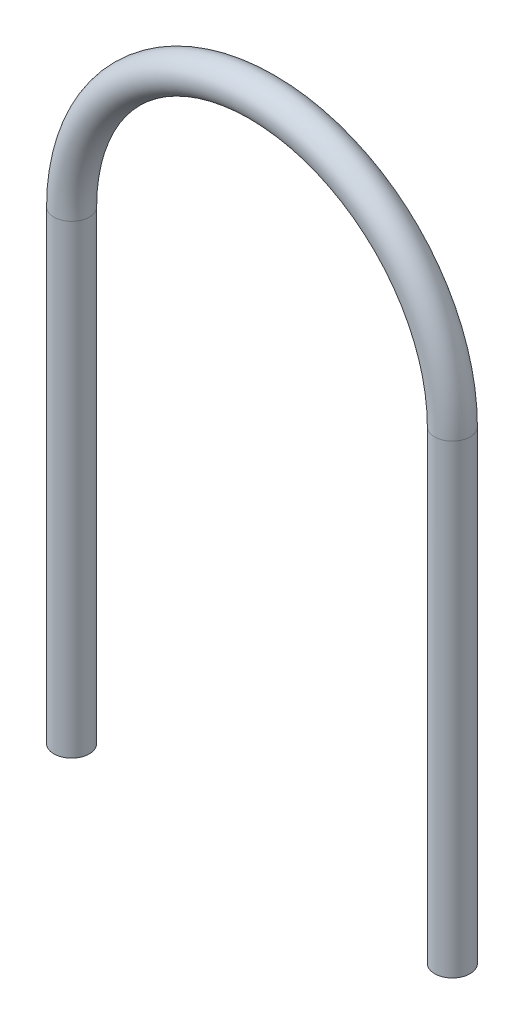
from build123d import *

# Parameters (mm, degrees)
SKETCH2_R = 3.175


with BuildPart() as part:
    # Sweep1: sweep along a path in Sketch1
    with BuildLine(Plane.XY) as sweep1_path:
        Line((-30.95625, -83.34375), (-30.95625, 0))
        ThreePointArc((-30.95625, 0), (0, 30.95625), (30.95625, 0))
        Line((30.95625, 0), (30.95625, -83.34375))
    # Sketch2 → Sweep1 (sweep)
    with BuildSketch(Plane(origin=(-6.182809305, -83.34375, 0), x_dir=(1, 0, 0), z_dir=(0, 1, 0))):
        with Locations((40.314059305, 0)):
            Circle(SKETCH2_R)
    sweep(path=sweep1_path.line)


solid = part.part
